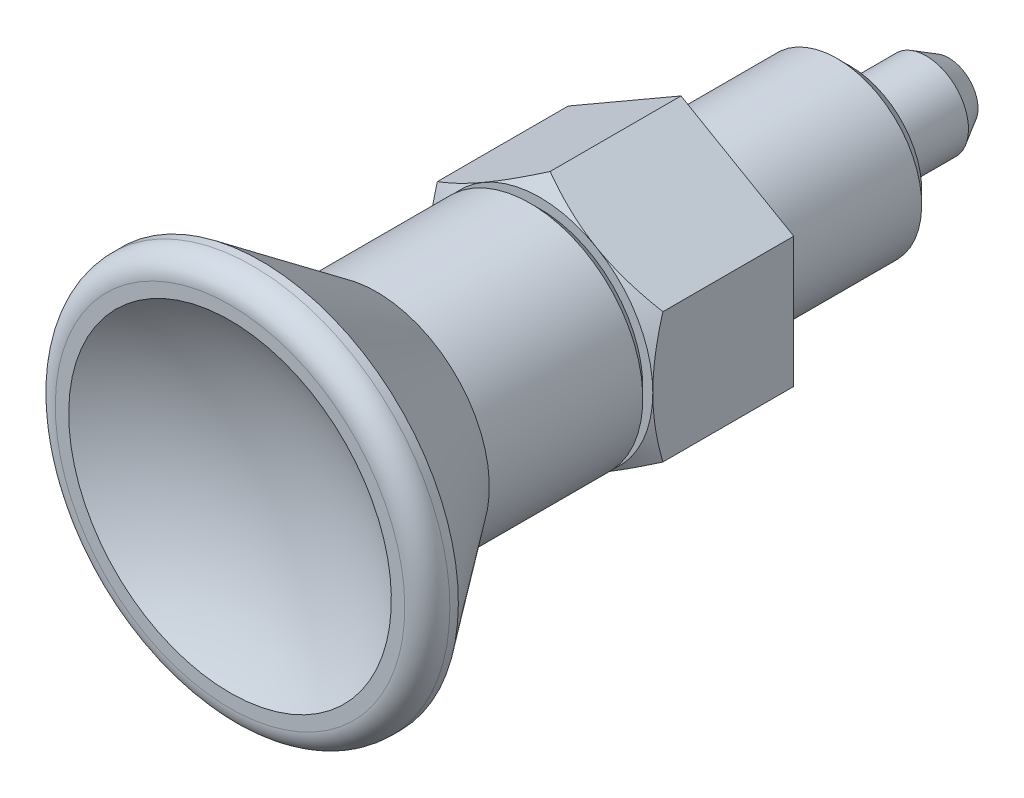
ISO-10303-21;
HEADER;
FILE_DESCRIPTION(('STEP AP214'),'2;1');
FILE_NAME('part.step','',(''),(''),'','','');
FILE_SCHEMA(('AUTOMOTIVE_DESIGN { 1 0 10303 214 1 1 1 1 }'));
ENDSEC;
DATA;
#1=APPLICATION_CONTEXT('core data for automotive mechanical design processes');
#2=APPLICATION_PROTOCOL_DEFINITION('international standard','automotive_design',2000,#1);
#3=PRODUCT_CONTEXT('',#1,'mechanical');
#4=PRODUCT('Part','Part','',(#3));
#5=PRODUCT_RELATED_PRODUCT_CATEGORY('part','',(#4));
#6=PRODUCT_DEFINITION_FORMATION('','',#4);
#7=PRODUCT_DEFINITION_CONTEXT('part definition',#1,'design');
#8=PRODUCT_DEFINITION('design','',#6,#7);
#9=PRODUCT_DEFINITION_SHAPE('','',#8);
#10=(LENGTH_UNIT() NAMED_UNIT(*) SI_UNIT(.MILLI.,.METRE.));
#11=(NAMED_UNIT(*) PLANE_ANGLE_UNIT() SI_UNIT($,.RADIAN.));
#12=(NAMED_UNIT(*) SI_UNIT($,.STERADIAN.) SOLID_ANGLE_UNIT());
#13=UNCERTAINTY_MEASURE_WITH_UNIT(LENGTH_MEASURE(1.E-05),#10,'distance_accuracy_value','');
#14=(GEOMETRIC_REPRESENTATION_CONTEXT(3) GLOBAL_UNCERTAINTY_ASSIGNED_CONTEXT((#13)) GLOBAL_UNIT_ASSIGNED_CONTEXT((#10,
#11,#12)) REPRESENTATION_CONTEXT('',''));
#15=CARTESIAN_POINT('',(0.,0.,0.));
#16=DIRECTION('',(0.,0.,1.));
#17=DIRECTION('',(1.,0.,0.));
#18=AXIS2_PLACEMENT_3D('',#15,#16,#17);
#19=CARTESIAN_POINT('',(0.,0.,3.8452994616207));
#20=DIRECTION('',(0.,0.,-1.));
#21=DIRECTION('',(0.866025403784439,-0.5,0.));
#22=AXIS2_PLACEMENT_3D('',#19,#20,#21);
#23=CONICAL_SURFACE('',#22,6.,1.04719755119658);
#24=CARTESIAN_POINT('',(-4.,2.30963201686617,4.64266774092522));
#25=CARTESIAN_POINT('',(-4.,2.1066597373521,4.70128212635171));
#26=CARTESIAN_POINT('',(-4.,1.90193541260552,4.75458967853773));
#27=CARTESIAN_POINT('',(-4.,1.48894178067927,4.84763832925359));
#28=CARTESIAN_POINT('',(-4.,1.28066513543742,4.88734651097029));
#29=CARTESIAN_POINT('',(-4.,0.866693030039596,4.94915778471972));
#30=CARTESIAN_POINT('',(-4.,0.661061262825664,4.97167226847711));
#31=CARTESIAN_POINT('',(-4.,0.24883020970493,4.99854937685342));
#32=CARTESIAN_POINT('',(-4.,0.0422324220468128,5.00293425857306));
#33=CARTESIAN_POINT('',(-4.,-0.343803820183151,4.99380992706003));
#34=CARTESIAN_POINT('',(-4.,-0.523300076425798,4.98254104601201));
#35=CARTESIAN_POINT('',(-4.,-0.881123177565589,4.9468260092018));
#36=CARTESIAN_POINT('',(-4.,-1.05944878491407,4.92236765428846));
#37=CARTESIAN_POINT('',(-4.,-1.41800959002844,4.8612239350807));
#38=CARTESIAN_POINT('',(-4.,-1.59819940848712,4.82427939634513));
#39=CARTESIAN_POINT('',(-4.,-1.9558916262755,4.74042992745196));
#40=CARTESIAN_POINT('',(-4.,-2.13339860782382,4.69354469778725));
#41=CARTESIAN_POINT('',(-4.,-2.30963201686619,4.64266774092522));
#42=B_SPLINE_CURVE_WITH_KNOTS('',3,(#24,#25,#26,#27,#28,#29,#30,#31,#32,#33,#34,#35,#36,#37,#38,
#39,#40,#41),.UNSPECIFIED.,.F.,.F.,(4,2,2,2,2,2,2,2,4),(0.,0.634047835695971,1.26961969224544,
1.88946157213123,2.50854226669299,3.04757825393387,3.58711366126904,4.13861653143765,
4.68903648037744),.UNSPECIFIED.);
#43=CARTESIAN_POINT('',(-4.,0.,5.));
#44=VERTEX_POINT('',#43);
#45=CARTESIAN_POINT('',(-4.,-2.30940107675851,4.64273441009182));
#46=VERTEX_POINT('',#45);
#47=EDGE_CURVE('E208',#44,#46,#42,.T.);
#48=ORIENTED_EDGE('',*,*,#47,.T.);
#49=CARTESIAN_POINT('',(3.40068244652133,-6.58218707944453,3.03194747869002));
#50=CARTESIAN_POINT('',(3.24914515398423,-6.49469698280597,3.11696006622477));
#51=CARTESIAN_POINT('',(3.09726304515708,-6.40700780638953,3.20116698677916));
#52=CARTESIAN_POINT('',(2.79262594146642,-6.23112549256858,3.36751704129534));
#53=CARTESIAN_POINT('',(2.6398708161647,-6.14293227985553,3.44965985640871));
#54=CARTESIAN_POINT('',(2.33253090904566,-5.96548950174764,3.61183552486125));
#55=CARTESIAN_POINT('',(2.17794071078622,-5.87623680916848,3.69185473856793));
#56=CARTESIAN_POINT('',(1.86754071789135,-5.69702728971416,3.84866226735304));
#57=CARTESIAN_POINT('',(1.7117309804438,-5.60707049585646,3.92545073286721));
#58=CARTESIAN_POINT('',(1.39349873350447,-5.42333902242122,4.07740180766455));
#59=CARTESIAN_POINT('',(1.23102714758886,-5.32953600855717,4.15242811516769));
#60=CARTESIAN_POINT('',(0.904193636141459,-5.14083859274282,4.29688156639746));
#61=CARTESIAN_POINT('',(0.739831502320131,-5.0459440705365,4.36630808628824));
#62=CARTESIAN_POINT('',(0.409254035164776,-4.85508508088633,4.49776338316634));
#63=CARTESIAN_POINT('',(0.243043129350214,-4.75912316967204,4.55980685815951));
#64=CARTESIAN_POINT('',(-0.0917629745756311,-4.56582277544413,4.67452681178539));
#65=CARTESIAN_POINT('',(-0.260357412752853,-4.46848473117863,4.72720620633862));
#66=CARTESIAN_POINT('',(-0.599080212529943,-4.27292303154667,4.82040801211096));
#67=CARTESIAN_POINT('',(-0.769194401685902,-4.1747075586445,4.86099784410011));
#68=CARTESIAN_POINT('',(-1.11156811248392,-3.97703800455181,4.92775174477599));
#69=CARTESIAN_POINT('',(-1.28382742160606,-3.87758404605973,4.95391723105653));
#70=CARTESIAN_POINT('',(-1.62736939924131,-3.67923999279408,4.98939391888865));
#71=CARTESIAN_POINT('',(-1.79863466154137,-3.5803599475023,4.99892431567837));
#72=CARTESIAN_POINT('',(-2.14125400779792,-3.38254857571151,5.00090183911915));
#73=CARTESIAN_POINT('',(-2.31260809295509,-3.28361724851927,4.99334872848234));
#74=CARTESIAN_POINT('',(-2.60268103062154,-3.11614355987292,4.96664010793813));
#75=CARTESIAN_POINT('',(-2.7217067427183,-3.04742403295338,4.95166491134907));
#76=CARTESIAN_POINT('',(-2.95890019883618,-2.9104803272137,4.91438647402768));
#77=CARTESIAN_POINT('',(-3.07706782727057,-2.84225621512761,4.89208226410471));
#78=CARTESIAN_POINT('',(-3.43011927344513,-2.63842186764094,4.81534673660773));
#79=CARTESIAN_POINT('',(-3.66342259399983,-2.50372413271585,4.75110599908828));
#80=CARTESIAN_POINT('',(-4.01230328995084,-2.30229776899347,4.63951703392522));
#81=CARTESIAN_POINT('',(-4.12968485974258,-2.23452748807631,4.59925972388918));
#82=CARTESIAN_POINT('',(-4.36330814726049,-2.09964502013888,4.51451498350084));
#83=CARTESIAN_POINT('',(-4.47954985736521,-2.03253283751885,4.47002752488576));
#84=CARTESIAN_POINT('',(-4.71092933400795,-1.89894583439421,4.37754043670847));
#85=CARTESIAN_POINT('',(-4.82606744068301,-1.83247081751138,4.32954193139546));
#86=CARTESIAN_POINT('',(-5.0553869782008,-1.70007312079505,4.23060228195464));
#87=CARTESIAN_POINT('',(-5.16956842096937,-1.63415043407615,4.17966117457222));
#88=CARTESIAN_POINT('',(-5.44172819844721,-1.47701891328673,4.05484839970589));
#89=CARTESIAN_POINT('',(-5.59930910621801,-1.38603953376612,3.97982329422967));
#90=CARTESIAN_POINT('',(-5.91310267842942,-1.20487073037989,3.82603918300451));
#91=CARTESIAN_POINT('',(-6.06931525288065,-1.11468135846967,3.74727993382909));
#92=CARTESIAN_POINT('',(-6.38062802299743,-0.93494484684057,3.58678806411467));
#93=CARTESIAN_POINT('',(-6.53572797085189,-0.845397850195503,3.50505480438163));
#94=CARTESIAN_POINT('',(-6.84497444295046,-0.666854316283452,3.33921405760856));
#95=CARTESIAN_POINT('',(-6.99912094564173,-0.57785779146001,3.25510651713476));
#96=CARTESIAN_POINT('',(-7.46071687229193,-0.311355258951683,2.99973471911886));
#97=CARTESIAN_POINT('',(-7.76697561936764,-0.134536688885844,2.82560283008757));
#98=CARTESIAN_POINT('',(-8.37720834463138,0.217781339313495,2.47222645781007));
#99=CARTESIAN_POINT('',(-8.6811826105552,0.393280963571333,2.29298263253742));
#100=CARTESIAN_POINT('',(-9.26152267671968,0.728340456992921,1.94637634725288));
#101=CARTESIAN_POINT('',(-9.53802222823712,0.887977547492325,1.77931192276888));
#102=CARTESIAN_POINT('',(-10.0899918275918,1.20665734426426,1.44290549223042));
#103=CARTESIAN_POINT('',(-10.3654618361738,1.3657000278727,1.27356340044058));
#104=CARTESIAN_POINT('',(-10.9148833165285,1.68290866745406,0.93358958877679));
#105=CARTESIAN_POINT('',(-11.1888368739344,1.84107582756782,0.762962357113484));
#106=CARTESIAN_POINT('',(-11.7360871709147,2.15703093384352,0.420351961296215));
#107=CARTESIAN_POINT('',(-12.0093839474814,2.31481890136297,0.24836887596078));
#108=CARTESIAN_POINT('',(-12.2824399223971,2.47246784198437,0.0758812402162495));
#109=B_SPLINE_CURVE_WITH_KNOTS('',3,(#49,#50,#51,#52,#53,#54,#55,#56,#57,#58,#59,#60,#61,#62,
#63,#64,#65,#66,#67,#68,#69,#70,#71,#72,#73,#74,#75,#76,#77,#78,#79,#80,#81,#82,#83,#84,#85,#86,
#87,#88,#89,#90,#91,#92,#93,#94,#95,#96,#97,#98,#99,#100,#101,#102,#103,#104,#105,#106,#107,
#108),.UNSPECIFIED.,.F.,.F.,(4,2,2,2,2,2,2,2,2,2,2,2,2,2,2,2,2,2,2,2,2,2,2,2,2,2,2,2,2,4),(0.,
0.5836223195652,1.16733424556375,1.75416907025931,2.34097653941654,2.94706311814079,
3.55321712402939,4.15814347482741,4.76288112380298,5.36418027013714,5.96542031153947,
6.55867644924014,7.15194082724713,7.56649775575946,7.98110952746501,8.8107799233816,
9.23492134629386,9.65906560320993,10.0830746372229,10.5070783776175,11.0974789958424,
11.6879181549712,12.2784849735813,12.8690650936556,14.0515449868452,15.2338733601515,
16.3148878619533,17.3959431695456,18.4741925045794,19.5523796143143),.UNSPECIFIED.);
#110=CARTESIAN_POINT('',(-2.,-3.46410161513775,5.));
#111=VERTEX_POINT('',#110);
#112=EDGE_CURVE('E9',#46,#111,#109,.F.);
#113=ORIENTED_EDGE('',*,*,#112,.T.);
#114=CARTESIAN_POINT('',(0.,0.,5.));
#115=DIRECTION('',(0.,0.,-1.));
#116=DIRECTION('',(0.866025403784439,-0.5,0.));
#117=AXIS2_PLACEMENT_3D('',#114,#115,#116);
#118=CIRCLE('',#117,4.);
#119=EDGE_CURVE('E123',#111,#44,#118,.T.);
#120=ORIENTED_EDGE('',*,*,#119,.T.);
#121=EDGE_LOOP('',(#48,#113,#120));
#122=FACE_BOUND('',#121,.T.);
#123=ADVANCED_FACE('F14',(#122),#23,.T.);
#124=CARTESIAN_POINT('',(2.,-3.46410161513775,5.));
#125=VERTEX_POINT('',#124);
#126=EDGE_CURVE('E117',#125,#111,#118,.T.);
#127=ORIENTED_EDGE('',*,*,#126,.T.);
#128=CARTESIAN_POINT('',(0.,-4.61880215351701,4.64273441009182));
#129=VERTEX_POINT('',#128);
#130=EDGE_CURVE('E18',#111,#129,#109,.F.);
#131=ORIENTED_EDGE('',*,*,#130,.T.);
#132=CARTESIAN_POINT('',(-0.000200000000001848,-4.61891762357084,4.64266774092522));
#133=CARTESIAN_POINT('',(0.17557915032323,-4.5174314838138,4.7012821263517));
#134=CARTESIAN_POINT('',(0.352875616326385,-4.41506932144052,4.75458967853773));
#135=CARTESIAN_POINT('',(0.710538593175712,-4.2085725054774,4.84763832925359));
#136=CARTESIAN_POINT('',(0.890911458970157,-4.10443418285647,4.88734651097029));
#137=CARTESIAN_POINT('',(1.2494218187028,-3.89744813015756,4.94915778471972));
#138=CARTESIAN_POINT('',(1.42750415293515,-3.79463224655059,4.97167226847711));
#139=CARTESIAN_POINT('',(1.78450671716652,-3.58851671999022,4.99854937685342));
#140=CARTESIAN_POINT('',(1.96342564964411,-3.48521782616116,5.00293425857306));
#141=CARTESIAN_POINT('',(2.29774284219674,-3.29219970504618,4.99380992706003));
#142=CARTESIAN_POINT('',(2.45319115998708,-3.20245157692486,4.98254104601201));
#143=CARTESIAN_POINT('',(2.76307505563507,-3.02354002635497,4.9468260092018));
#144=CARTESIAN_POINT('',(2.91750956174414,-2.93437722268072,4.92236765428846));
#145=CARTESIAN_POINT('',(3.22803232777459,-2.75509682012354,4.8612239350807));
#146=CARTESIAN_POINT('',(3.38408128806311,-2.6650019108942,4.82427939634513));
#147=CARTESIAN_POINT('',(3.69385183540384,-2.48615580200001,4.74042992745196));
#148=CARTESIAN_POINT('',(3.84757739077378,-2.39740231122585,4.69354469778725));
#149=CARTESIAN_POINT('',(4.0002,-2.30928560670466,4.64266774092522));
#150=B_SPLINE_CURVE_WITH_KNOTS('',3,(#132,#133,#134,#135,#136,#137,#138,#139,#140,#141,#142,
#143,#144,#145,#146,#147,#148,#149),.UNSPECIFIED.,.F.,.F.,(4,2,2,2,2,2,2,2,4),(0.,
0.63404783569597,1.26961969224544,1.88946157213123,2.50854226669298,3.04757825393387,
3.58711366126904,4.13861653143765,4.68903648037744),.UNSPECIFIED.);
#151=EDGE_CURVE('E217',#129,#125,#150,.T.);
#152=ORIENTED_EDGE('',*,*,#151,.T.);
#153=EDGE_LOOP('',(#127,#131,#152));
#154=FACE_BOUND('',#153,.T.);
#155=ADVANCED_FACE('F230',(#154),#23,.T.);
#156=CARTESIAN_POINT('',(4.,0.,5.));
#157=VERTEX_POINT('',#156);
#158=EDGE_CURVE('E105',#157,#125,#118,.T.);
#159=ORIENTED_EDGE('',*,*,#158,.T.);
#160=CARTESIAN_POINT('',(4.,-2.3094010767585,4.64273441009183));
#161=VERTEX_POINT('',#160);
#162=EDGE_CURVE('E106',#125,#161,#150,.T.);
#163=ORIENTED_EDGE('',*,*,#162,.T.);
#164=CARTESIAN_POINT('',(4.,-2.30963201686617,4.64266774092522));
#165=CARTESIAN_POINT('',(4.,-2.1066597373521,4.70128212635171));
#166=CARTESIAN_POINT('',(4.,-1.90193541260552,4.75458967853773));
#167=CARTESIAN_POINT('',(4.,-1.48894178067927,4.84763832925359));
#168=CARTESIAN_POINT('',(4.,-1.28066513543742,4.88734651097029));
#169=CARTESIAN_POINT('',(4.,-0.866693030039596,4.94915778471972));
#170=CARTESIAN_POINT('',(4.,-0.661061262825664,4.97167226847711));
#171=CARTESIAN_POINT('',(4.,-0.24883020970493,4.99854937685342));
#172=CARTESIAN_POINT('',(4.,-0.0422324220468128,5.00293425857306));
#173=CARTESIAN_POINT('',(4.,0.343803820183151,4.99380992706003));
#174=CARTESIAN_POINT('',(4.,0.523300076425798,4.98254104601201));
#175=CARTESIAN_POINT('',(4.,0.881123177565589,4.9468260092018));
#176=CARTESIAN_POINT('',(4.,1.05944878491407,4.92236765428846));
#177=CARTESIAN_POINT('',(4.,1.41800959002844,4.8612239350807));
#178=CARTESIAN_POINT('',(4.,1.59819940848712,4.82427939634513));
#179=CARTESIAN_POINT('',(4.,1.9558916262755,4.74042992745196));
#180=CARTESIAN_POINT('',(4.,2.13339860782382,4.69354469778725));
#181=CARTESIAN_POINT('',(4.,2.30963201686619,4.64266774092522));
#182=B_SPLINE_CURVE_WITH_KNOTS('',3,(#164,#165,#166,#167,#168,#169,#170,#171,#172,#173,#174,
#175,#176,#177,#178,#179,#180,#181),.UNSPECIFIED.,.F.,.F.,(4,2,2,2,2,2,2,2,4),(0.,
0.634047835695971,1.26961969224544,1.88946157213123,2.50854226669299,3.04757825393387,
3.58711366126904,4.13861653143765,4.68903648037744),.UNSPECIFIED.);
#183=EDGE_CURVE('E93',#161,#157,#182,.T.);
#184=ORIENTED_EDGE('',*,*,#183,.T.);
#185=EDGE_LOOP('',(#159,#163,#184));
#186=FACE_BOUND('',#185,.T.);
#187=ADVANCED_FACE('F104',(#186),#23,.T.);
#188=CARTESIAN_POINT('',(0.000200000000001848,4.61891762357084,4.64266774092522));
#189=CARTESIAN_POINT('',(-0.17557915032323,4.5174314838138,4.7012821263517));
#190=CARTESIAN_POINT('',(-0.352875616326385,4.41506932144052,4.75458967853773));
#191=CARTESIAN_POINT('',(-0.710538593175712,4.2085725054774,4.84763832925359));
#192=CARTESIAN_POINT('',(-0.890911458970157,4.10443418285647,4.88734651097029));
#193=CARTESIAN_POINT('',(-1.2494218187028,3.89744813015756,4.94915778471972));
#194=CARTESIAN_POINT('',(-1.42750415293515,3.79463224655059,4.97167226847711));
#195=CARTESIAN_POINT('',(-1.78450671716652,3.58851671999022,4.99854937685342));
#196=CARTESIAN_POINT('',(-1.96342564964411,3.48521782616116,5.00293425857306));
#197=CARTESIAN_POINT('',(-2.29774284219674,3.29219970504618,4.99380992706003));
#198=CARTESIAN_POINT('',(-2.45319115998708,3.20245157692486,4.98254104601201));
#199=CARTESIAN_POINT('',(-2.76307505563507,3.02354002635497,4.9468260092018));
#200=CARTESIAN_POINT('',(-2.91750956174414,2.93437722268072,4.92236765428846));
#201=CARTESIAN_POINT('',(-3.22803232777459,2.75509682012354,4.8612239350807));
#202=CARTESIAN_POINT('',(-3.38408128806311,2.6650019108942,4.82427939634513));
#203=CARTESIAN_POINT('',(-3.69385183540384,2.48615580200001,4.74042992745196));
#204=CARTESIAN_POINT('',(-3.84757739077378,2.39740231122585,4.69354469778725));
#205=CARTESIAN_POINT('',(-4.0002,2.30928560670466,4.64266774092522));
#206=B_SPLINE_CURVE_WITH_KNOTS('',3,(#188,#189,#190,#191,#192,#193,#194,#195,#196,#197,#198,
#199,#200,#201,#202,#203,#204,#205),.UNSPECIFIED.,.F.,.F.,(4,2,2,2,2,2,2,2,4),(0.,
0.63404783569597,1.26961969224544,1.88946157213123,2.50854226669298,3.04757825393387,
3.58711366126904,4.13861653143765,4.68903648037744),.UNSPECIFIED.);
#207=CARTESIAN_POINT('',(-2.,3.46410161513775,5.));
#208=VERTEX_POINT('',#207);
#209=CARTESIAN_POINT('',(-4.,2.3094010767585,4.64273441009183));
#210=VERTEX_POINT('',#209);
#211=EDGE_CURVE('E107',#208,#210,#206,.T.);
#212=ORIENTED_EDGE('',*,*,#211,.T.);
#213=EDGE_CURVE('E202',#210,#44,#42,.T.);
#214=ORIENTED_EDGE('',*,*,#213,.T.);
#215=EDGE_CURVE('E122',#44,#208,#118,.T.);
#216=ORIENTED_EDGE('',*,*,#215,.T.);
#217=EDGE_LOOP('',(#212,#214,#216));
#218=FACE_BOUND('',#217,.T.);
#219=ADVANCED_FACE('F248',(#218),#23,.T.);
#220=CARTESIAN_POINT('',(2.,3.46410161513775,5.));
#221=VERTEX_POINT('',#220);
#222=EDGE_CURVE('E114',#221,#157,#118,.T.);
#223=ORIENTED_EDGE('',*,*,#222,.T.);
#224=CARTESIAN_POINT('',(4.,2.30940107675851,4.64273441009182));
#225=VERTEX_POINT('',#224);
#226=EDGE_CURVE('E89',#157,#225,#182,.T.);
#227=ORIENTED_EDGE('',*,*,#226,.T.);
#228=CARTESIAN_POINT('',(7.40068244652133,0.346016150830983,3.03194747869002));
#229=CARTESIAN_POINT('',(7.24914515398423,0.433506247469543,3.11696006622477));
#230=CARTESIAN_POINT('',(7.09726304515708,0.521195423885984,3.20116698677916));
#231=CARTESIAN_POINT('',(6.79262594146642,0.697077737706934,3.36751704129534));
#232=CARTESIAN_POINT('',(6.6398708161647,0.78527095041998,3.44965985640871));
#233=CARTESIAN_POINT('',(6.33253090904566,0.962713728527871,3.61183552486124));
#234=CARTESIAN_POINT('',(6.17794071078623,1.05196642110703,3.69185473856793));
#235=CARTESIAN_POINT('',(5.86754071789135,1.23117594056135,3.84866226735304));
#236=CARTESIAN_POINT('',(5.7117309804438,1.32113273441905,3.92545073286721));
#237=CARTESIAN_POINT('',(5.39349873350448,1.50486420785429,4.07740180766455));
#238=CARTESIAN_POINT('',(5.23102714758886,1.59866722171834,4.15242811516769));
#239=CARTESIAN_POINT('',(4.90419363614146,1.78736463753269,4.29688156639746));
#240=CARTESIAN_POINT('',(4.73983150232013,1.88225915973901,4.36630808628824));
#241=CARTESIAN_POINT('',(4.40925403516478,2.07311814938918,4.49776338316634));
#242=CARTESIAN_POINT('',(4.24304312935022,2.16908006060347,4.55980685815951));
#243=CARTESIAN_POINT('',(3.90823702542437,2.36238045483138,4.67452681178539));
#244=CARTESIAN_POINT('',(3.73964258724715,2.45971849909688,4.72720620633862));
#245=CARTESIAN_POINT('',(3.40091978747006,2.65528019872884,4.82040801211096));
#246=CARTESIAN_POINT('',(3.2308055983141,2.75349567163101,4.86099784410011));
#247=CARTESIAN_POINT('',(2.88843188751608,2.9511652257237,4.92775174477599));
#248=CARTESIAN_POINT('',(2.71617257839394,3.05061918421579,4.95391723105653));
#249=CARTESIAN_POINT('',(2.37263060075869,3.24896323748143,4.98939391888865));
#250=CARTESIAN_POINT('',(2.20136533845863,3.34784328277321,4.99892431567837));
#251=CARTESIAN_POINT('',(1.85874599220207,3.545654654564,5.00090183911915));
#252=CARTESIAN_POINT('',(1.6873919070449,3.64458598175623,4.99334872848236));
#253=CARTESIAN_POINT('',(1.39731896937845,3.81205967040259,4.96664010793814));
#254=CARTESIAN_POINT('',(1.2782932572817,3.88077919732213,4.95166491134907));
#255=CARTESIAN_POINT('',(1.04109980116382,4.01772290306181,4.91438647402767));
#256=CARTESIAN_POINT('',(0.922932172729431,4.08594701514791,4.89208226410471));
#257=CARTESIAN_POINT('',(0.569880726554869,4.28978136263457,4.81534673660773));
#258=CARTESIAN_POINT('',(0.33657740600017,4.42447909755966,4.75110599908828));
#259=CARTESIAN_POINT('',(-0.0123032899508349,4.62590546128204,4.63951703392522));
#260=CARTESIAN_POINT('',(-0.12968485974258,4.69367574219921,4.59925972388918));
#261=CARTESIAN_POINT('',(-0.363308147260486,4.82855821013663,4.51451498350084));
#262=CARTESIAN_POINT('',(-0.479549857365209,4.89567039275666,4.47002752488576));
#263=CARTESIAN_POINT('',(-0.710929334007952,5.0292573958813,4.37754043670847));
#264=CARTESIAN_POINT('',(-0.826067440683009,5.09573241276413,4.32954193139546));
#265=CARTESIAN_POINT('',(-1.0553869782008,5.22813010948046,4.23060228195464));
#266=CARTESIAN_POINT('',(-1.16956842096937,5.29405279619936,4.17966117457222));
#267=CARTESIAN_POINT('',(-1.44172819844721,5.45118431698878,4.05484839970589));
#268=CARTESIAN_POINT('',(-1.59930910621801,5.54216369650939,3.97982329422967));
#269=CARTESIAN_POINT('',(-1.91310267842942,5.72333249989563,3.82603918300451));
#270=CARTESIAN_POINT('',(-2.06931525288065,5.81352187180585,3.74727993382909));
#271=CARTESIAN_POINT('',(-2.38062802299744,5.99325838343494,3.58678806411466));
#272=CARTESIAN_POINT('',(-2.53572797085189,6.08280538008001,3.50505480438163));
#273=CARTESIAN_POINT('',(-2.84497444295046,6.26134891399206,3.33921405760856));
#274=CARTESIAN_POINT('',(-2.99912094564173,6.3503454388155,3.25510651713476));
#275=CARTESIAN_POINT('',(-3.46071687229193,6.61684797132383,2.99973471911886));
#276=CARTESIAN_POINT('',(-3.76697561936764,6.79366654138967,2.82560283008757));
#277=CARTESIAN_POINT('',(-4.37720834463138,7.14598456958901,2.47222645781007));
#278=CARTESIAN_POINT('',(-4.6811826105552,7.32148419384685,2.29298263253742));
#279=CARTESIAN_POINT('',(-5.26152267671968,7.65654368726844,1.94637634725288));
#280=CARTESIAN_POINT('',(-5.53802222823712,7.81618077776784,1.77931192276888));
#281=CARTESIAN_POINT('',(-6.08999182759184,8.13486057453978,1.44290549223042));
#282=CARTESIAN_POINT('',(-6.36546183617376,8.29390325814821,1.27356340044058));
#283=CARTESIAN_POINT('',(-6.91488331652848,8.61111189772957,0.933589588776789));
#284=CARTESIAN_POINT('',(-7.18883687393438,8.76927905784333,0.762962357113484));
#285=CARTESIAN_POINT('',(-7.73608717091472,9.08523416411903,0.420351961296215));
#286=CARTESIAN_POINT('',(-8.00938394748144,9.24302213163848,0.24836887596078));
#287=CARTESIAN_POINT('',(-8.28243992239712,9.40067107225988,0.0758812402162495));
#288=B_SPLINE_CURVE_WITH_KNOTS('',3,(#228,#229,#230,#231,#232,#233,#234,#235,#236,#237,#238,
#239,#240,#241,#242,#243,#244,#245,#246,#247,#248,#249,#250,#251,#252,#253,#254,#255,#256,#257,
#258,#259,#260,#261,#262,#263,#264,#265,#266,#267,#268,#269,#270,#271,#272,#273,#274,#275,#276,
#277,#278,#279,#280,#281,#282,#283,#284,#285,#286,#287),.UNSPECIFIED.,.F.,.F.,(4,2,2,2,2,2,2,2,
2,2,2,2,2,2,2,2,2,2,2,2,2,2,2,2,2,2,2,2,2,4),(0.,0.583622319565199,1.16733424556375,
1.75416907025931,2.34097653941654,2.94706311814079,3.55321712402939,4.1581434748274,
4.76288112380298,5.36418027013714,5.96542031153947,6.55867644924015,7.15194082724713,
7.56649775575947,7.98110952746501,8.8107799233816,9.23492134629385,9.65906560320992,
10.0830746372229,10.5070783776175,11.0974789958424,11.6879181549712,12.2784849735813,
12.8690650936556,14.0515449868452,15.2338733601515,16.3148878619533,17.3959431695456,
18.4741925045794,19.5523796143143),.UNSPECIFIED.);
#289=EDGE_CURVE('E120',#225,#221,#288,.T.);
#290=ORIENTED_EDGE('',*,*,#289,.T.);
#291=EDGE_LOOP('',(#223,#227,#290));
#292=FACE_BOUND('',#291,.T.);
#293=ADVANCED_FACE('F119',(#292),#23,.T.);
#294=CARTESIAN_POINT('',(0.,4.61880215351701,4.64273441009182));
#295=VERTEX_POINT('',#294);
#296=EDGE_CURVE('E168',#221,#295,#288,.T.);
#297=ORIENTED_EDGE('',*,*,#296,.T.);
#298=EDGE_CURVE('E98',#295,#208,#206,.T.);
#299=ORIENTED_EDGE('',*,*,#298,.T.);
#300=EDGE_CURVE('E121',#208,#221,#118,.T.);
#301=ORIENTED_EDGE('',*,*,#300,.T.);
#302=EDGE_LOOP('',(#297,#299,#301));
#303=FACE_BOUND('',#302,.T.);
#304=ADVANCED_FACE('F232',(#303),#23,.T.);
#305=CARTESIAN_POINT('',(-1.20346441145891E-13,-2.08446150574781E-13,24.1999999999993));
#306=DIRECTION('',(0.,0.,-1.));
#307=DIRECTION('',(0.5,0.866025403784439,0.));
#308=AXIS2_PLACEMENT_3D('',#305,#306,#307);
#309=SPHERICAL_SURFACE('',#308,9.99999999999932);
#310=CARTESIAN_POINT('',(0.,0.,16.));
#311=DIRECTION('',(0.,0.,-1.));
#312=DIRECTION('',(0.866025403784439,-0.5,0.));
#313=AXIS2_PLACEMENT_3D('',#310,#311,#312);
#314=CIRCLE('',#313,5.7236352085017);
#315=CARTESIAN_POINT('',(4.95681349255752,-2.86181760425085,16.));
#316=VERTEX_POINT('',#315);
#317=EDGE_CURVE('E165',#316,#316,#314,.T.);
#318=ORIENTED_EDGE('',*,*,#317,.F.);
#319=EDGE_LOOP('',(#318));
#320=FACE_BOUND('',#319,.T.);
#321=ADVANCED_FACE('F16',(#320),#309,.F.);
#322=CARTESIAN_POINT('',(-2.86181760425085,-4.95681349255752,16.));
#323=DIRECTION('',(0.,0.,-1.));
#324=DIRECTION('',(0.866025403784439,-0.5,0.));
#325=AXIS2_PLACEMENT_3D('',#322,#323,#324);
#326=PLANE('',#325);
#327=CARTESIAN_POINT('',(0.,0.,16.));
#328=DIRECTION('',(0.,0.,-1.));
#329=DIRECTION('',(0.866025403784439,-0.5,0.));
#330=AXIS2_PLACEMENT_3D('',#327,#328,#329);
#331=CIRCLE('',#330,6.2);
#332=CARTESIAN_POINT('',(5.36935750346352,-3.1,16.));
#333=VERTEX_POINT('',#332);
#334=EDGE_CURVE('E162',#333,#333,#331,.T.);
#335=ORIENTED_EDGE('',*,*,#334,.F.);
#336=EDGE_LOOP('',(#335));
#337=FACE_BOUND('',#336,.T.);
#338=ORIENTED_EDGE('',*,*,#317,.T.);
#339=EDGE_LOOP('',(#338));
#340=FACE_BOUND('',#339,.T.);
#341=ADVANCED_FACE('F246',(#337,#340),#326,.F.);
#342=CARTESIAN_POINT('',(0.,0.,15.1999999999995));
#343=DIRECTION('',(0.,0.,-1.));
#344=DIRECTION('',(0.866025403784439,-0.5,0.));
#345=AXIS2_PLACEMENT_3D('',#342,#343,#344);
#346=TOROIDAL_SURFACE('',#345,6.19999999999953,0.800000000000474);
#347=ORIENTED_EDGE('',*,*,#334,.T.);
#348=EDGE_LOOP('',(#347));
#349=FACE_BOUND('',#348,.T.);
#350=CARTESIAN_POINT('',(0.,0.,15.1999999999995));
#351=DIRECTION('',(0.,0.,-1.));
#352=DIRECTION('',(0.866025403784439,-0.5,0.));
#353=AXIS2_PLACEMENT_3D('',#350,#351,#352);
#354=CIRCLE('',#353,7.);
#355=CARTESIAN_POINT('',(6.06217782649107,-3.5,15.1999999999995));
#356=VERTEX_POINT('',#355);
#357=EDGE_CURVE('E159',#356,#356,#354,.T.);
#358=ORIENTED_EDGE('',*,*,#357,.F.);
#359=EDGE_LOOP('',(#358));
#360=FACE_BOUND('',#359,.T.);
#361=ADVANCED_FACE('F340',(#349,#360),#346,.T.);
#362=CARTESIAN_POINT('',(0.,0.,-9.5));
#363=DIRECTION('',(0.,0.,-1.));
#364=DIRECTION('',(0.866025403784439,-0.5,0.));
#365=AXIS2_PLACEMENT_3D('',#362,#363,#364);
#366=CYLINDRICAL_SURFACE('',#365,7.);
#367=CARTESIAN_POINT('',(0.,0.,14.8989801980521));
#368=DIRECTION('',(0.,0.,-1.));
#369=DIRECTION('',(0.866025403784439,-0.5,0.));
#370=AXIS2_PLACEMENT_3D('',#367,#368,#369);
#371=CIRCLE('',#370,7.);
#372=CARTESIAN_POINT('',(6.06217782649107,-3.5,14.8989801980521));
#373=VERTEX_POINT('',#372);
#374=EDGE_CURVE('E156',#373,#373,#371,.T.);
#375=ORIENTED_EDGE('',*,*,#374,.F.);
#376=EDGE_LOOP('',(#375));
#377=FACE_BOUND('',#376,.T.);
#378=ORIENTED_EDGE('',*,*,#357,.T.);
#379=EDGE_LOOP('',(#378));
#380=FACE_BOUND('',#379,.T.);
#381=ADVANCED_FACE('F336',(#377,#380),#366,.T.);
#382=CARTESIAN_POINT('',(0.,0.,14.8989801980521));
#383=DIRECTION('',(0.,0.,1.));
#384=DIRECTION('',(-0.866025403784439,0.5,0.));
#385=AXIS2_PLACEMENT_3D('',#382,#383,#384);
#386=CONICAL_SURFACE('',#385,7.,0.631809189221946);
#387=CARTESIAN_POINT('',(0.,0.,10.8));
#388=DIRECTION('',(0.,0.,-1.));
#389=DIRECTION('',(0.866025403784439,-0.5,0.));
#390=AXIS2_PLACEMENT_3D('',#387,#388,#389);
#391=CIRCLE('',#390,4.);
#392=CARTESIAN_POINT('',(3.46410161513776,-2.,10.8));
#393=VERTEX_POINT('',#392);
#394=EDGE_CURVE('E153',#393,#393,#391,.T.);
#395=ORIENTED_EDGE('',*,*,#394,.F.);
#396=EDGE_LOOP('',(#395));
#397=FACE_BOUND('',#396,.T.);
#398=ORIENTED_EDGE('',*,*,#374,.T.);
#399=EDGE_LOOP('',(#398));
#400=FACE_BOUND('',#399,.T.);
#401=ADVANCED_FACE('F332',(#397,#400),#386,.T.);
#402=CARTESIAN_POINT('',(0.,0.,-9.5));
#403=DIRECTION('',(0.,0.,-1.));
#404=DIRECTION('',(0.866025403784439,-0.5,0.));
#405=AXIS2_PLACEMENT_3D('',#402,#403,#404);
#406=CYLINDRICAL_SURFACE('',#405,4.);
#407=CARTESIAN_POINT('',(0.,0.,5.35355339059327));
#408=DIRECTION('',(0.,0.,-1.));
#409=DIRECTION('',(0.866025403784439,-0.5,0.));
#410=AXIS2_PLACEMENT_3D('',#407,#408,#409);
#411=CIRCLE('',#410,4.);
#412=CARTESIAN_POINT('',(3.46410161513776,-2.,5.35355339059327));
#413=VERTEX_POINT('',#412);
#414=EDGE_CURVE('E150',#413,#413,#411,.T.);
#415=ORIENTED_EDGE('',*,*,#414,.F.);
#416=EDGE_LOOP('',(#415));
#417=FACE_BOUND('',#416,.T.);
#418=ORIENTED_EDGE('',*,*,#394,.T.);
#419=EDGE_LOOP('',(#418));
#420=FACE_BOUND('',#419,.T.);
#421=ADVANCED_FACE('F328',(#417,#420),#406,.T.);
#422=CARTESIAN_POINT('',(0.,0.,5.35355339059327));
#423=DIRECTION('',(0.,0.,1.));
#424=DIRECTION('',(-0.866025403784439,0.5,0.));
#425=AXIS2_PLACEMENT_3D('',#422,#423,#424);
#426=CONICAL_SURFACE('',#425,4.,0.78539816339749);
#427=CARTESIAN_POINT('',(0.,0.,5.));
#428=DIRECTION('',(0.,0.,-1.));
#429=DIRECTION('',(0.866025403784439,-0.5,0.));
#430=AXIS2_PLACEMENT_3D('',#427,#428,#429);
#431=CIRCLE('',#430,3.6464466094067);
#432=CARTESIAN_POINT('',(3.15791539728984,-1.82322330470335,5.));
#433=VERTEX_POINT('',#432);
#434=EDGE_CURVE('E147',#433,#433,#431,.T.);
#435=ORIENTED_EDGE('',*,*,#434,.F.);
#436=EDGE_LOOP('',(#435));
#437=FACE_BOUND('',#436,.T.);
#438=ORIENTED_EDGE('',*,*,#414,.T.);
#439=EDGE_LOOP('',(#438));
#440=FACE_BOUND('',#439,.T.);
#441=ADVANCED_FACE('F325',(#437,#440),#426,.T.);
#442=CARTESIAN_POINT('',(-2.,-3.46410161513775,5.));
#443=DIRECTION('',(0.,0.,1.));
#444=DIRECTION('',(-0.866025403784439,0.5,0.));
#445=AXIS2_PLACEMENT_3D('',#442,#443,#444);
#446=PLANE('',#445);
#447=ORIENTED_EDGE('',*,*,#434,.T.);
#448=EDGE_LOOP('',(#447));
#449=FACE_BOUND('',#448,.T.);
#450=ORIENTED_EDGE('',*,*,#119,.F.);
#451=ORIENTED_EDGE('',*,*,#126,.F.);
#452=ORIENTED_EDGE('',*,*,#158,.F.);
#453=ORIENTED_EDGE('',*,*,#222,.F.);
#454=ORIENTED_EDGE('',*,*,#300,.F.);
#455=ORIENTED_EDGE('',*,*,#215,.F.);
#456=EDGE_LOOP('',(#450,#451,#452,#453,#454,#455));
#457=FACE_BOUND('',#456,.T.);
#458=ADVANCED_FACE('F112',(#449,#457),#446,.T.);
#459=CARTESIAN_POINT('',(4.,-2.3094010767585,-2.));
#460=DIRECTION('',(1.,0.,0.));
#461=DIRECTION('',(0.,1.,0.));
#462=AXIS2_PLACEMENT_3D('',#459,#460,#461);
#463=PLANE('',#462);
#464=DIRECTION('',(0.,0.,1.));
#465=VECTOR('',#464,1.);
#466=CARTESIAN_POINT('',(4.,2.30940107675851,-2.));
#467=LINE('',#466,#465);
#468=CARTESIAN_POINT('',(4.,2.30940107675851,0.));
#469=VERTEX_POINT('',#468);
#470=EDGE_CURVE('E35',#469,#225,#467,.T.);
#471=ORIENTED_EDGE('',*,*,#470,.T.);
#472=ORIENTED_EDGE('',*,*,#226,.F.);
#473=ORIENTED_EDGE('',*,*,#183,.F.);
#474=DIRECTION('',(0.,0.,1.));
#475=VECTOR('',#474,1.);
#476=CARTESIAN_POINT('',(4.,-2.3094010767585,-2.));
#477=LINE('',#476,#475);
#478=CARTESIAN_POINT('',(4.,-2.3094010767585,0.));
#479=VERTEX_POINT('',#478);
#480=EDGE_CURVE('E269',#479,#161,#477,.T.);
#481=ORIENTED_EDGE('',*,*,#480,.F.);
#482=DIRECTION('',(0.,-1.,0.));
#483=VECTOR('',#482,1.);
#484=CARTESIAN_POINT('',(4.,-2.59807621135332,0.));
#485=LINE('',#484,#483);
#486=EDGE_CURVE('E128',#469,#479,#485,.T.);
#487=ORIENTED_EDGE('',*,*,#486,.F.);
#488=EDGE_LOOP('',(#471,#472,#473,#481,#487));
#489=FACE_BOUND('',#488,.T.);
#490=ADVANCED_FACE('F91',(#489),#463,.T.);
#491=CARTESIAN_POINT('',(0.,-4.61880215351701,-2.));
#492=DIRECTION('',(0.5,-0.866025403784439,0.));
#493=DIRECTION('',(0.866025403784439,0.5,0.));
#494=AXIS2_PLACEMENT_3D('',#491,#492,#493);
#495=PLANE('',#494);
#496=ORIENTED_EDGE('',*,*,#480,.T.);
#497=ORIENTED_EDGE('',*,*,#162,.F.);
#498=ORIENTED_EDGE('',*,*,#151,.F.);
#499=DIRECTION('',(0.,0.,1.));
#500=VECTOR('',#499,1.);
#501=CARTESIAN_POINT('',(0.,-4.61880215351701,-2.));
#502=LINE('',#501,#500);
#503=CARTESIAN_POINT('',(0.,-4.61880215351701,0.));
#504=VERTEX_POINT('',#503);
#505=EDGE_CURVE('E264',#504,#129,#502,.T.);
#506=ORIENTED_EDGE('',*,*,#505,.F.);
#507=DIRECTION('',(-0.866025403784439,-0.5,0.));
#508=VECTOR('',#507,1.);
#509=CARTESIAN_POINT('',(-0.25,-4.76313972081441,0.));
#510=LINE('',#509,#508);
#511=EDGE_CURVE('E280',#479,#504,#510,.T.);
#512=ORIENTED_EDGE('',*,*,#511,.F.);
#513=EDGE_LOOP('',(#496,#497,#498,#506,#512));
#514=FACE_BOUND('',#513,.T.);
#515=ADVANCED_FACE('F218',(#514),#495,.T.);
#516=CARTESIAN_POINT('',(-4.,-2.30940107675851,-2.));
#517=DIRECTION('',(-0.5,-0.866025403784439,0.));
#518=DIRECTION('',(0.866025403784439,-0.5,0.));
#519=AXIS2_PLACEMENT_3D('',#516,#517,#518);
#520=PLANE('',#519);
#521=ORIENTED_EDGE('',*,*,#505,.T.);
#522=ORIENTED_EDGE('',*,*,#130,.F.);
#523=ORIENTED_EDGE('',*,*,#112,.F.);
#524=DIRECTION('',(0.,0.,1.));
#525=VECTOR('',#524,1.);
#526=CARTESIAN_POINT('',(-4.,-2.30940107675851,-2.));
#527=LINE('',#526,#525);
#528=CARTESIAN_POINT('',(-4.,-2.30940107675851,0.));
#529=VERTEX_POINT('',#528);
#530=EDGE_CURVE('E261',#529,#46,#527,.T.);
#531=ORIENTED_EDGE('',*,*,#530,.F.);
#532=DIRECTION('',(-0.866025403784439,0.5,0.));
#533=VECTOR('',#532,1.);
#534=CARTESIAN_POINT('',(-2.,-3.46410161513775,0.));
#535=LINE('',#534,#533);
#536=EDGE_CURVE('E279',#504,#529,#535,.T.);
#537=ORIENTED_EDGE('',*,*,#536,.F.);
#538=EDGE_LOOP('',(#521,#522,#523,#531,#537));
#539=FACE_BOUND('',#538,.T.);
#540=ADVANCED_FACE('F198',(#539),#520,.T.);
#541=CARTESIAN_POINT('',(-4.,2.3094010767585,-2.));
#542=DIRECTION('',(-1.,0.,0.));
#543=DIRECTION('',(0.,-1.,0.));
#544=AXIS2_PLACEMENT_3D('',#541,#542,#543);
#545=PLANE('',#544);
#546=ORIENTED_EDGE('',*,*,#530,.T.);
#547=ORIENTED_EDGE('',*,*,#47,.F.);
#548=ORIENTED_EDGE('',*,*,#213,.F.);
#549=DIRECTION('',(0.,0.,1.));
#550=VECTOR('',#549,1.);
#551=CARTESIAN_POINT('',(-4.,2.3094010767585,-2.));
#552=LINE('',#551,#550);
#553=CARTESIAN_POINT('',(-4.,2.3094010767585,0.));
#554=VERTEX_POINT('',#553);
#555=EDGE_CURVE('E256',#554,#210,#552,.T.);
#556=ORIENTED_EDGE('',*,*,#555,.F.);
#557=DIRECTION('',(0.,1.,0.));
#558=VECTOR('',#557,1.);
#559=CARTESIAN_POINT('',(-4.,-2.59807621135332,0.));
#560=LINE('',#559,#558);
#561=EDGE_CURVE('E277',#529,#554,#560,.T.);
#562=ORIENTED_EDGE('',*,*,#561,.F.);
#563=EDGE_LOOP('',(#546,#547,#548,#556,#562));
#564=FACE_BOUND('',#563,.T.);
#565=ADVANCED_FACE('F194',(#564),#545,.T.);
#566=CARTESIAN_POINT('',(0.,4.61880215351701,-2.));
#567=DIRECTION('',(-0.5,0.866025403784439,0.));
#568=DIRECTION('',(-0.866025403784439,-0.5,0.));
#569=AXIS2_PLACEMENT_3D('',#566,#567,#568);
#570=PLANE('',#569);
#571=ORIENTED_EDGE('',*,*,#555,.T.);
#572=ORIENTED_EDGE('',*,*,#211,.F.);
#573=ORIENTED_EDGE('',*,*,#298,.F.);
#574=DIRECTION('',(0.,0.,1.));
#575=VECTOR('',#574,1.);
#576=CARTESIAN_POINT('',(0.,4.61880215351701,-2.));
#577=LINE('',#576,#575);
#578=CARTESIAN_POINT('',(0.,4.61880215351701,0.));
#579=VERTEX_POINT('',#578);
#580=EDGE_CURVE('E41',#579,#295,#577,.T.);
#581=ORIENTED_EDGE('',*,*,#580,.F.);
#582=DIRECTION('',(0.866025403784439,0.5,0.));
#583=VECTOR('',#582,1.);
#584=CARTESIAN_POINT('',(-4.25,2.16506350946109,0.));
#585=LINE('',#584,#583);
#586=EDGE_CURVE('E258',#554,#579,#585,.T.);
#587=ORIENTED_EDGE('',*,*,#586,.F.);
#588=EDGE_LOOP('',(#571,#572,#573,#581,#587));
#589=FACE_BOUND('',#588,.T.);
#590=ADVANCED_FACE('F189',(#589),#570,.T.);
#591=CARTESIAN_POINT('',(4.,2.30940107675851,-2.));
#592=DIRECTION('',(0.5,0.866025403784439,0.));
#593=DIRECTION('',(-0.866025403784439,0.5,0.));
#594=AXIS2_PLACEMENT_3D('',#591,#592,#593);
#595=PLANE('',#594);
#596=ORIENTED_EDGE('',*,*,#580,.T.);
#597=ORIENTED_EDGE('',*,*,#296,.F.);
#598=ORIENTED_EDGE('',*,*,#289,.F.);
#599=ORIENTED_EDGE('',*,*,#470,.F.);
#600=DIRECTION('',(0.866025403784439,-0.5,0.));
#601=VECTOR('',#600,1.);
#602=CARTESIAN_POINT('',(2.,3.46410161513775,0.));
#603=LINE('',#602,#601);
#604=EDGE_CURVE('E271',#579,#469,#603,.T.);
#605=ORIENTED_EDGE('',*,*,#604,.F.);
#606=EDGE_LOOP('',(#596,#597,#598,#599,#605));
#607=FACE_BOUND('',#606,.T.);
#608=ADVANCED_FACE('F184',(#607),#595,.T.);
#609=CARTESIAN_POINT('',(-0.51905989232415,-0.899038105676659,-9.5));
#610=DIRECTION('',(0.,0.,1.));
#611=DIRECTION('',(-0.866025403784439,0.5,0.));
#612=AXIS2_PLACEMENT_3D('',#609,#610,#611);
#613=PLANE('',#612);
#614=CARTESIAN_POINT('',(0.,0.,-9.5));
#615=DIRECTION('',(0.,0.,-1.));
#616=DIRECTION('',(0.866025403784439,-0.5,0.));
#617=AXIS2_PLACEMENT_3D('',#614,#615,#616);
#618=CIRCLE('',#617,1.0381197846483);
#619=CARTESIAN_POINT('',(0.899038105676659,-0.51905989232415,-9.5));
#620=VERTEX_POINT('',#619);
#621=EDGE_CURVE('E141',#620,#620,#618,.T.);
#622=ORIENTED_EDGE('',*,*,#621,.T.);
#623=EDGE_LOOP('',(#622));
#624=FACE_BOUND('',#623,.T.);
#625=ADVANCED_FACE('F188',(#624),#613,.F.);
#626=CARTESIAN_POINT('',(0.,0.,-8.7));
#627=DIRECTION('',(0.,0.,1.));
#628=DIRECTION('',(-0.866025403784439,0.5,0.));
#629=AXIS2_PLACEMENT_3D('',#626,#627,#628);
#630=CONICAL_SURFACE('',#629,1.5,0.523598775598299);
#631=ORIENTED_EDGE('',*,*,#621,.F.);
#632=EDGE_LOOP('',(#631));
#633=FACE_BOUND('',#632,.T.);
#634=CARTESIAN_POINT('',(0.,0.,-8.7));
#635=DIRECTION('',(0.,0.,-1.));
#636=DIRECTION('',(0.866025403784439,-0.5,0.));
#637=AXIS2_PLACEMENT_3D('',#634,#635,#636);
#638=CIRCLE('',#637,1.5);
#639=CARTESIAN_POINT('',(1.29903810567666,-0.75,-8.7));
#640=VERTEX_POINT('',#639);
#641=EDGE_CURVE('E144',#640,#640,#638,.T.);
#642=ORIENTED_EDGE('',*,*,#641,.T.);
#643=EDGE_LOOP('',(#642));
#644=FACE_BOUND('',#643,.T.);
#645=ADVANCED_FACE('F313',(#633,#644),#630,.T.);
#646=CARTESIAN_POINT('',(0.,0.,-9.5));
#647=DIRECTION('',(0.,0.,-1.));
#648=DIRECTION('',(0.866025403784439,-0.5,0.));
#649=AXIS2_PLACEMENT_3D('',#646,#647,#648);
#650=CYLINDRICAL_SURFACE('',#649,1.5);
#651=ORIENTED_EDGE('',*,*,#641,.F.);
#652=EDGE_LOOP('',(#651));
#653=FACE_BOUND('',#652,.T.);
#654=CARTESIAN_POINT('',(0.,0.,-6.));
#655=DIRECTION('',(0.,0.,-1.));
#656=DIRECTION('',(0.866025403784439,-0.5,0.));
#657=AXIS2_PLACEMENT_3D('',#654,#655,#656);
#658=CIRCLE('',#657,1.5);
#659=CARTESIAN_POINT('',(1.29903810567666,-0.75,-6.));
#660=VERTEX_POINT('',#659);
#661=EDGE_CURVE('E138',#660,#660,#658,.T.);
#662=ORIENTED_EDGE('',*,*,#661,.T.);
#663=EDGE_LOOP('',(#662));
#664=FACE_BOUND('',#663,.T.);
#665=ADVANCED_FACE('F308',(#653,#664),#650,.T.);
#666=CARTESIAN_POINT('',(-0.75,-1.29903810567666,-6.));
#667=DIRECTION('',(0.,0.,-1.));
#668=DIRECTION('',(0.866025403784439,-0.5,0.));
#669=AXIS2_PLACEMENT_3D('',#666,#667,#668);
#670=PLANE('',#669);
#671=CARTESIAN_POINT('',(0.,0.,-6.));
#672=DIRECTION('',(0.,0.,-1.));
#673=DIRECTION('',(0.866025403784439,-0.5,0.));
#674=AXIS2_PLACEMENT_3D('',#671,#672,#673);
#675=CIRCLE('',#674,2.54);
#676=CARTESIAN_POINT('',(2.19970452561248,-1.27,-6.));
#677=VERTEX_POINT('',#676);
#678=EDGE_CURVE('E135',#677,#677,#675,.T.);
#679=ORIENTED_EDGE('',*,*,#678,.T.);
#680=EDGE_LOOP('',(#679));
#681=FACE_BOUND('',#680,.T.);
#682=ORIENTED_EDGE('',*,*,#661,.F.);
#683=EDGE_LOOP('',(#682));
#684=FACE_BOUND('',#683,.T.);
#685=ADVANCED_FACE('F302',(#681,#684),#670,.T.);
#686=CARTESIAN_POINT('',(0.,0.,-6.));
#687=DIRECTION('',(0.,0.,1.));
#688=DIRECTION('',(-0.866025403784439,0.5,0.));
#689=AXIS2_PLACEMENT_3D('',#686,#687,#688);
#690=CONICAL_SURFACE('',#689,2.54,0.785398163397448);
#691=CARTESIAN_POINT('',(0.,0.,-5.54));
#692=DIRECTION('',(0.,0.,-1.));
#693=DIRECTION('',(0.866025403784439,-0.5,0.));
#694=AXIS2_PLACEMENT_3D('',#691,#692,#693);
#695=CIRCLE('',#694,3.);
#696=CARTESIAN_POINT('',(2.59807621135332,-1.5,-5.54));
#697=VERTEX_POINT('',#696);
#698=EDGE_CURVE('E132',#697,#697,#695,.T.);
#699=ORIENTED_EDGE('',*,*,#698,.T.);
#700=EDGE_LOOP('',(#699));
#701=FACE_BOUND('',#700,.T.);
#702=ORIENTED_EDGE('',*,*,#678,.F.);
#703=EDGE_LOOP('',(#702));
#704=FACE_BOUND('',#703,.T.);
#705=ADVANCED_FACE('F296',(#701,#704),#690,.T.);
#706=CARTESIAN_POINT('',(0.,0.,-6.));
#707=DIRECTION('',(0.,0.,-1.));
#708=DIRECTION('',(0.866025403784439,-0.5,0.));
#709=AXIS2_PLACEMENT_3D('',#706,#707,#708);
#710=CYLINDRICAL_SURFACE('',#709,3.);
#711=CARTESIAN_POINT('',(0.,0.,0.));
#712=DIRECTION('',(0.,0.,-1.));
#713=DIRECTION('',(0.866025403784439,-0.5,0.));
#714=AXIS2_PLACEMENT_3D('',#711,#712,#713);
#715=CIRCLE('',#714,3.);
#716=CARTESIAN_POINT('',(2.59807621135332,-1.5,0.));
#717=VERTEX_POINT('',#716);
#718=EDGE_CURVE('E127',#717,#717,#715,.T.);
#719=ORIENTED_EDGE('',*,*,#718,.T.);
#720=EDGE_LOOP('',(#719));
#721=FACE_BOUND('',#720,.T.);
#722=ORIENTED_EDGE('',*,*,#698,.F.);
#723=EDGE_LOOP('',(#722));
#724=FACE_BOUND('',#723,.T.);
#725=ADVANCED_FACE('F291',(#721,#724),#710,.T.);
#726=CARTESIAN_POINT('',(-1.5,-2.59807621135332,0.));
#727=DIRECTION('',(0.,0.,-1.));
#728=DIRECTION('',(0.866025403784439,-0.5,0.));
#729=AXIS2_PLACEMENT_3D('',#726,#727,#728);
#730=PLANE('',#729);
#731=ORIENTED_EDGE('',*,*,#536,.T.);
#732=ORIENTED_EDGE('',*,*,#561,.T.);
#733=ORIENTED_EDGE('',*,*,#586,.T.);
#734=ORIENTED_EDGE('',*,*,#604,.T.);
#735=ORIENTED_EDGE('',*,*,#486,.T.);
#736=ORIENTED_EDGE('',*,*,#511,.T.);
#737=EDGE_LOOP('',(#731,#732,#733,#734,#735,#736));
#738=FACE_BOUND('',#737,.T.);
#739=ORIENTED_EDGE('',*,*,#718,.F.);
#740=EDGE_LOOP('',(#739));
#741=FACE_BOUND('',#740,.T.);
#742=ADVANCED_FACE('F287',(#738,#741),#730,.T.);
#743=CLOSED_SHELL('',(#123,#155,#187,#219,#293,#304,#321,#341,#361,#381,#401,#421,#441,#458,
#490,#515,#540,#565,#590,#608,#625,#645,#665,#685,#705,#725,#742));
#744=MANIFOLD_SOLID_BREP('B1',#743);
#745=ADVANCED_BREP_SHAPE_REPRESENTATION('',(#18,#744),#14);
#746=SHAPE_DEFINITION_REPRESENTATION(#9,#745);
ENDSEC;
END-ISO-10303-21;
